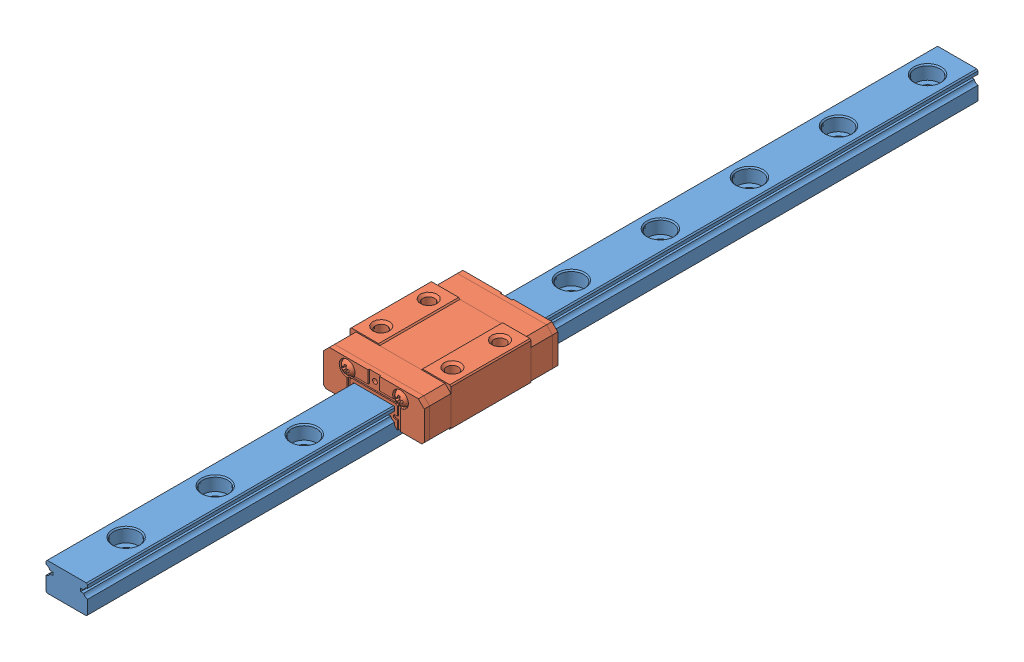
SolidWorks assembly MGN7 with rail.SLDASM, configuration MGN7C 150 mm (file format 11000). Lengths in mm.
Overall size (17 8.1 150).
2 component instances, 2 part files, 2 mates.
Components (placement in the parent):
- MGN7 rail-1: MGN7 rail.SLDPRT [150 mm] at origin size (7 4.8 150)
- MGN7C-1: MGN7C.SLDPRT [MGN7C] at (0 2.45 87.0293) size (17 6.5 23.31)
Mates (geometry in assembly coordinates):
- Coincident1: coincident: plane of MGN7 rail-1 through (-3.3 2.4 150) normal (0 1 0); plane of MGN7C-1 through (0 2.4 93.7793) normal (0 -1 0)
- Coincident2: coincident: plane of MGN7 rail-1 through (-3.5 -2.2 150) normal (-1 0 0); plane of MGN7C-1 through (-3.5 2.45 93.7793) normal (1 0 0)
